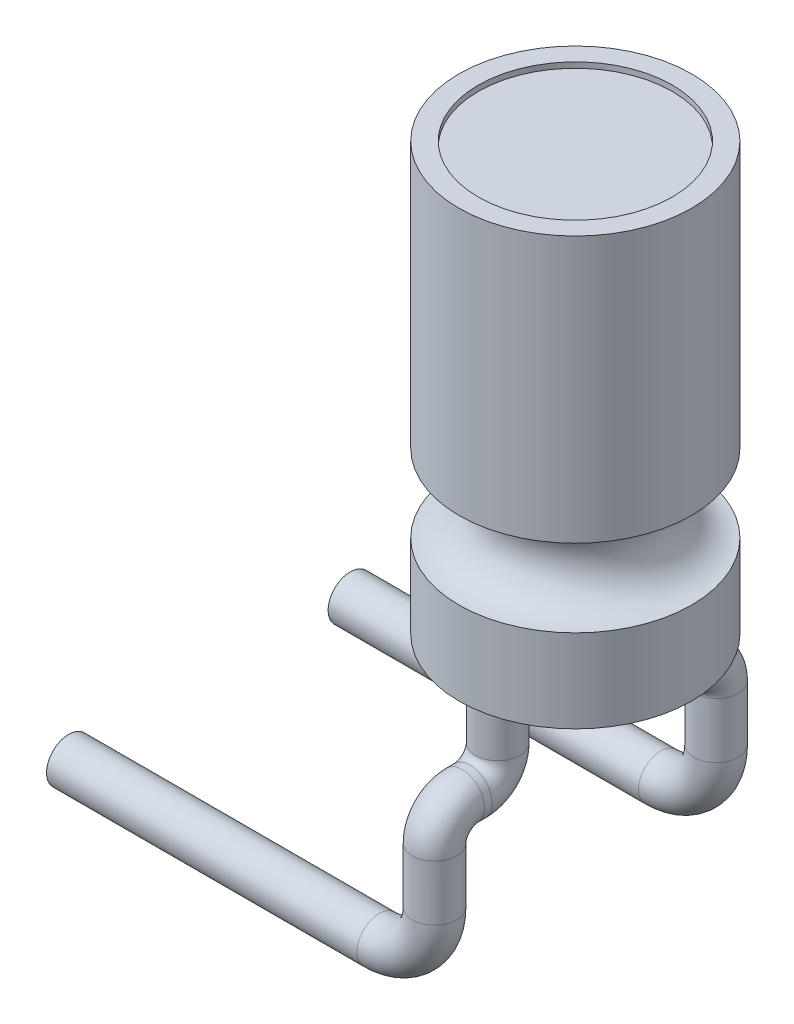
from build123d import *

# Parameters (mm, degrees)
ESQUISSE2_R             = 1.75
ENL_V_MAT_EXTRU_1_DEPTH = 0.1
ESQUISSE3_R             = 0.4
ESQUISSE5_R             = 0.4


with BuildPart() as part:
    # Esquisse1 → R_volution1 (revolve)
    with BuildSketch(Plane.XY, mode=Mode.PRIVATE) as r_volution1_sk:
        with BuildLine():
            Line((0, 35.216423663), (2.1, 35.216423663))
            Line((2.1, 35.216423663), (2.1, 30.416423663))
            ThreePointArc((2.1, 30.416423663), (1.4, 29.716423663), (2.1, 29.016423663))
            Line((2.1, 29.016423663), (2.1, 27.516423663))
            Line((2.1, 27.516423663), (0, 27.516423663))
            Line((0, 27.516423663), (0, 35.216423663))
        make_face()
    revolve(r_volution1_sk.sketch.rotate(Axis((0, 48.401709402, 0), (0, -1, 0)), 90), axis=Axis((0, 48.401709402, 0), (0, -1, 0)))

    # Esquisse2 → Enl_v. mat.-Extru.1 (cut)
    with BuildSketch(Plane(origin=(0, 35.216423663, 0), x_dir=(-1, 0, 0), z_dir=(0, 1, 0))):
        with Locations(Location((0, 0, 0), (0, 0, 90))):
            Circle(ESQUISSE2_R)
    extrude(amount=-ENL_V_MAT_EXTRU_1_DEPTH, mode=Mode.SUBTRACT)

    # Balayage1: sweep along a path in Esquisse4
    with BuildLine(Plane(origin=(0, 0, 0), x_dir=(0, 0, -1), z_dir=(1, 0, 0))) as balayage1_path:
        Line((-1.4, 27.516423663), (-1.4, 26.516423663))
        ThreePointArc((-1.4, 26.516423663), (-1.546446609, 26.162870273), (-1.9, 26.016423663))
        Line((-1.9, 26.016423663), (-2.04, 26.016423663))
        ThreePointArc((-2.04, 26.016423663), (-2.393553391, 25.869977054), (-2.54, 25.516423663))
    # Esquisse3 → Balayage1 (sweep)
    with BuildSketch(Plane.XZ.offset(-27.516423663)):
        with Locations((0, 1.4)):
            Circle(ESQUISSE3_R)
    balayage1 = sweep(path=balayage1_path.line)

    # Balayage2: sweep along a path in Esquisse6
    with BuildLine(Plane.XY.offset(2.54)) as balayage2_path:
        Line((0, 25.516423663), (0, 24.516423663))
        ThreePointArc((0, 24.516423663), (-0.292893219, 23.809316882), (-1, 23.516423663))
        Line((-1, 23.516423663), (-6.6, 23.516423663))
    # Esquisse5 → Balayage2 (sweep)
    with BuildSketch(Plane.XZ.offset(-25.516423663)):
        with Locations((0, 2.54)):
            Circle(ESQUISSE5_R)
    balayage2 = sweep(path=balayage2_path.line)

    # Sym_trie1: Balayage1, Balayage2 across plane
    add(balayage1.mirror(Plane.XY))
    add(balayage2.mirror(Plane.XY))


solid = part.part
